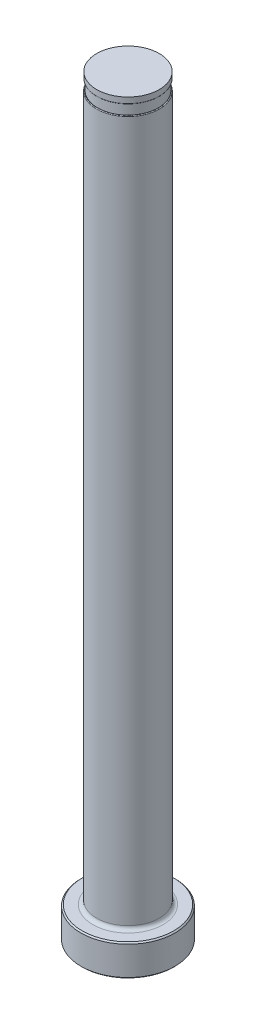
ISO-10303-21;
HEADER;
FILE_DESCRIPTION(('STEP AP214'),'2;1');
FILE_NAME('part.step','',(''),(''),'','','');
FILE_SCHEMA(('AUTOMOTIVE_DESIGN { 1 0 10303 214 1 1 1 1 }'));
ENDSEC;
DATA;
#1=APPLICATION_CONTEXT('core data for automotive mechanical design processes');
#2=APPLICATION_PROTOCOL_DEFINITION('international standard','automotive_design',2000,#1);
#3=PRODUCT_CONTEXT('',#1,'mechanical');
#4=PRODUCT('Part','Part','',(#3));
#5=PRODUCT_RELATED_PRODUCT_CATEGORY('part','',(#4));
#6=PRODUCT_DEFINITION_FORMATION('','',#4);
#7=PRODUCT_DEFINITION_CONTEXT('part definition',#1,'design');
#8=PRODUCT_DEFINITION('design','',#6,#7);
#9=PRODUCT_DEFINITION_SHAPE('','',#8);
#10=(LENGTH_UNIT() NAMED_UNIT(*) SI_UNIT(.MILLI.,.METRE.));
#11=(NAMED_UNIT(*) PLANE_ANGLE_UNIT() SI_UNIT($,.RADIAN.));
#12=(NAMED_UNIT(*) SI_UNIT($,.STERADIAN.) SOLID_ANGLE_UNIT());
#13=UNCERTAINTY_MEASURE_WITH_UNIT(LENGTH_MEASURE(1.E-05),#10,'distance_accuracy_value','');
#14=(GEOMETRIC_REPRESENTATION_CONTEXT(3) GLOBAL_UNCERTAINTY_ASSIGNED_CONTEXT((#13)) GLOBAL_UNIT_ASSIGNED_CONTEXT((#10,
#11,#12)) REPRESENTATION_CONTEXT('',''));
#15=CARTESIAN_POINT('',(0.,0.,0.));
#16=DIRECTION('',(0.,0.,1.));
#17=DIRECTION('',(1.,0.,0.));
#18=AXIS2_PLACEMENT_3D('',#15,#16,#17);
#19=CARTESIAN_POINT('',(-6.34999999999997,151.13,0.));
#20=DIRECTION('',(0.,1.,0.));
#21=DIRECTION('',(0.,0.,1.));
#22=AXIS2_PLACEMENT_3D('',#19,#20,#21);
#23=PLANE('',#22);
#24=CARTESIAN_POINT('',(0.,151.13,0.));
#25=DIRECTION('',(0.,1.,0.));
#26=DIRECTION('',(0.,0.,1.));
#27=AXIS2_PLACEMENT_3D('',#24,#25,#26);
#28=CIRCLE('',#27,6.20394999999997);
#29=CARTESIAN_POINT('',(0.,151.13,6.20394999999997));
#30=VERTEX_POINT('',#29);
#31=EDGE_CURVE('E11',#30,#30,#28,.F.);
#32=ORIENTED_EDGE('',*,*,#31,.T.);
#33=EDGE_LOOP('',(#32));
#34=FACE_BOUND('',#33,.T.);
#35=CARTESIAN_POINT('',(0.,151.13,0.));
#36=DIRECTION('',(0.,1.,0.));
#37=DIRECTION('',(0.,0.,1.));
#38=AXIS2_PLACEMENT_3D('',#35,#36,#37);
#39=CIRCLE('',#38,6.14679999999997);
#40=CARTESIAN_POINT('',(0.,151.13,6.14679999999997));
#41=VERTEX_POINT('',#40);
#42=EDGE_CURVE('E78',#41,#41,#39,.T.);
#43=ORIENTED_EDGE('',*,*,#42,.T.);
#44=EDGE_LOOP('',(#43));
#45=FACE_BOUND('',#44,.T.);
#46=ADVANCED_FACE('F36',(#34,#45),#23,.F.);
#47=CARTESIAN_POINT('',(0.,259.958771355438,0.));
#48=DIRECTION('',(0.,1.,0.));
#49=DIRECTION('',(0.,0.,1.));
#50=AXIS2_PLACEMENT_3D('',#47,#48,#49);
#51=CYLINDRICAL_SURFACE('',#50,6.34999999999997);
#52=DIRECTION('',(0.,1.,0.));
#53=VECTOR('',#52,1.);
#54=CARTESIAN_POINT('',(-6.14679999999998,259.958771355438,-1.59353373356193));
#55=LINE('',#54,#53);
#56=CARTESIAN_POINT('',(-6.14679999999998,148.971,-1.59353373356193));
#57=VERTEX_POINT('',#56);
#58=CARTESIAN_POINT('',(-6.14679999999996,86.614,-1.59353373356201));
#59=VERTEX_POINT('',#58);
#60=EDGE_CURVE('E73',#57,#59,#55,.F.);
#61=ORIENTED_EDGE('',*,*,#60,.F.);
#62=CARTESIAN_POINT('',(0.,148.971,0.));
#63=DIRECTION('',(0.,-1.,0.));
#64=DIRECTION('',(0.,0.,-1.));
#65=AXIS2_PLACEMENT_3D('',#62,#63,#64);
#66=CIRCLE('',#65,6.34999999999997);
#67=CARTESIAN_POINT('',(-6.14679999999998,148.971,1.59353373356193));
#68=VERTEX_POINT('',#67);
#69=EDGE_CURVE('E51',#57,#68,#66,.T.);
#70=ORIENTED_EDGE('',*,*,#69,.T.);
#71=DIRECTION('',(0.,1.,0.));
#72=VECTOR('',#71,1.);
#73=CARTESIAN_POINT('',(-6.14679999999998,259.958771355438,1.59353373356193));
#74=LINE('',#73,#72);
#75=CARTESIAN_POINT('',(-6.14679999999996,86.614,1.59353373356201));
#76=VERTEX_POINT('',#75);
#77=EDGE_CURVE('E84',#76,#68,#74,.T.);
#78=ORIENTED_EDGE('',*,*,#77,.F.);
#79=CARTESIAN_POINT('',(-6.14679999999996,86.614,-1.59353373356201));
#80=CARTESIAN_POINT('',(-6.14679686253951,86.5864663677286,-1.59353938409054));
#81=CARTESIAN_POINT('',(-6.14715862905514,86.5589529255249,-1.59215087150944));
#82=CARTESIAN_POINT('',(-6.14858031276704,86.5042441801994,-1.58665454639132));
#83=CARTESIAN_POINT('',(-6.1496395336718,86.4770485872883,-1.58254944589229));
#84=CARTESIAN_POINT('',(-6.15378495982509,86.3968935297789,-1.56638373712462));
#85=CARTESIAN_POINT('',(-6.15784047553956,86.3447192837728,-1.55046902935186));
#86=CARTESIAN_POINT('',(-6.16796669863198,86.2445368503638,-1.50967436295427));
#87=CARTESIAN_POINT('',(-6.17403041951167,86.1965149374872,-1.48482546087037));
#88=CARTESIAN_POINT('',(-6.18749023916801,86.1052134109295,-1.42770042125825));
#89=CARTESIAN_POINT('',(-6.19488985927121,86.0619468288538,-1.39540459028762));
#90=CARTESIAN_POINT('',(-6.2128308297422,85.9675154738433,-1.31357934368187));
#91=CARTESIAN_POINT('',(-6.22361527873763,85.9183096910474,-1.26185217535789));
#92=CARTESIAN_POINT('',(-6.24504791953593,85.8289285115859,-1.15112070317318));
#93=CARTESIAN_POINT('',(-6.25569585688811,85.7887681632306,-1.09210452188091));
#94=CARTESIAN_POINT('',(-6.27981252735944,85.703163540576,-0.94543699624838));
#95=CARTESIAN_POINT('',(-6.29280304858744,85.661570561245,-0.855464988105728));
#96=CARTESIAN_POINT('',(-6.3152685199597,85.59288021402,-0.669832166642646));
#97=CARTESIAN_POINT('',(-6.32474033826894,85.5657957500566,-0.574166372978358));
#98=CARTESIAN_POINT('',(-6.33958312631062,85.5242724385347,-0.377105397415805));
#99=CARTESIAN_POINT('',(-6.34483489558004,85.510199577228,-0.275625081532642));
#100=CARTESIAN_POINT('',(-6.35041977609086,85.4952595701,-0.0715187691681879));
#101=CARTESIAN_POINT('',(-6.35074885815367,85.494403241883,0.031108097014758));
#102=CARTESIAN_POINT('',(-6.34600640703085,85.5070416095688,0.256717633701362));
#103=CARTESIAN_POINT('',(-6.33980431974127,85.5235397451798,0.379522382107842));
#104=CARTESIAN_POINT('',(-6.32079279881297,85.576979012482,0.620117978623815));
#105=CARTESIAN_POINT('',(-6.30799326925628,85.6138895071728,0.737916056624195));
#106=CARTESIAN_POINT('',(-6.28320612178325,85.6928252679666,0.921417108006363));
#107=CARTESIAN_POINT('',(-6.27266140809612,85.7279385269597,0.990304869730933));
#108=CARTESIAN_POINT('',(-6.25047734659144,85.8081826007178,1.12180209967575));
#109=CARTESIAN_POINT('',(-6.23883987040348,85.8532964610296,1.18442193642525));
#110=CARTESIAN_POINT('',(-6.21836351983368,85.9425218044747,1.28706750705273));
#111=CARTESIAN_POINT('',(-6.20949901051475,85.9844586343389,1.32897137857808));
#112=CARTESIAN_POINT('',(-6.19260904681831,86.074662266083,1.40556985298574));
#113=CARTESIAN_POINT('',(-6.18458268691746,86.1229221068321,1.44027227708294));
#114=CARTESIAN_POINT('',(-6.17157345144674,86.215899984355,1.49493371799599));
#115=CARTESIAN_POINT('',(-6.16630262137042,86.2596744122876,1.51642497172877));
#116=CARTESIAN_POINT('',(-6.1574469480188,86.3502717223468,1.55199425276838));
#117=CARTESIAN_POINT('',(-6.15385883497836,86.3970884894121,1.56608666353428));
#118=CARTESIAN_POINT('',(-6.14982923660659,86.4725672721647,1.58181403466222));
#119=CARTESIAN_POINT('',(-6.14869942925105,86.5006434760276,1.58619374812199));
#120=CARTESIAN_POINT('',(-6.14718237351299,86.5571398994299,1.59205902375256));
#121=CARTESIAN_POINT('',(-6.14679576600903,86.5855603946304,1.59354208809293));
#122=CARTESIAN_POINT('',(-6.14679999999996,86.614,1.59353373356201));
#123=B_SPLINE_CURVE_WITH_KNOTS('',3,(#79,#80,#81,#82,#83,#84,#85,#86,#87,#88,#89,#90,#91,#92,
#93,#94,#95,#96,#97,#98,#99,#100,#101,#102,#103,#104,#105,#106,#107,#108,#109,#110,#111,#112,
#113,#114,#115,#116,#117,#118,#119,#120,#121,#122),.UNSPECIFIED.,.F.,.F.,(4,2,2,2,2,2,2,2,2,2,2,
2,2,2,2,2,2,2,2,2,2,4),(0.,0.0825255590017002,0.164968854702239,0.327951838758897,
0.490373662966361,0.653230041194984,0.868657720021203,1.08444118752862,1.38273372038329,
1.68129111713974,1.9880112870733,2.29498249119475,2.66541500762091,3.0352930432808,
3.2686988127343,3.50171186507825,3.68091203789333,3.85991655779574,4.00647458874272,
4.15274664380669,4.23791544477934,4.32315765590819),.UNSPECIFIED.);
#124=EDGE_CURVE('E81',#59,#76,#123,.T.);
#125=ORIENTED_EDGE('',*,*,#124,.F.);
#126=EDGE_LOOP('',(#61,#70,#78,#125));
#127=FACE_BOUND('',#126,.T.);
#128=CARTESIAN_POINT('',(0.,7.11200000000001,0.));
#129=DIRECTION('',(0.,1.,0.));
#130=DIRECTION('',(0.,0.,1.));
#131=AXIS2_PLACEMENT_3D('',#128,#129,#130);
#132=CIRCLE('',#131,6.34999999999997);
#133=CARTESIAN_POINT('',(0.,7.11200000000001,6.34999999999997));
#134=VERTEX_POINT('',#133);
#135=EDGE_CURVE('E116',#134,#134,#132,.T.);
#136=ORIENTED_EDGE('',*,*,#135,.T.);
#137=EDGE_LOOP('',(#136));
#138=FACE_BOUND('',#137,.T.);
#139=ADVANCED_FACE('F82',(#127,#138),#51,.T.);
#140=CARTESIAN_POINT('',(0.,0.,0.));
#141=DIRECTION('',(0.,-1.,0.));
#142=DIRECTION('',(0.,0.,-1.));
#143=AXIS2_PLACEMENT_3D('',#140,#141,#142);
#144=PLANE('',#143);
#145=CARTESIAN_POINT('',(0.,0.,0.));
#146=DIRECTION('',(0.,-1.,0.));
#147=DIRECTION('',(0.,0.,-1.));
#148=AXIS2_PLACEMENT_3D('',#145,#146,#147);
#149=CIRCLE('',#148,9.271);
#150=CARTESIAN_POINT('',(0.,0.,-9.271));
#151=VERTEX_POINT('',#150);
#152=EDGE_CURVE('E113',#151,#151,#149,.T.);
#153=ORIENTED_EDGE('',*,*,#152,.T.);
#154=EDGE_LOOP('',(#153));
#155=FACE_BOUND('',#154,.T.);
#156=ADVANCED_FACE('F192',(#155),#144,.T.);
#157=CARTESIAN_POINT('',(0.,259.958771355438,0.));
#158=DIRECTION('',(0.,1.,0.));
#159=DIRECTION('',(0.,0.,1.));
#160=AXIS2_PLACEMENT_3D('',#157,#158,#159);
#161=CYLINDRICAL_SURFACE('',#160,9.52499999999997);
#162=CARTESIAN_POINT('',(0.,6.09600000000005,0.));
#163=DIRECTION('',(0.,1.,0.));
#164=DIRECTION('',(0.,0.,1.));
#165=AXIS2_PLACEMENT_3D('',#162,#163,#164);
#166=CIRCLE('',#165,9.52499999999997);
#167=CARTESIAN_POINT('',(0.,6.09600000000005,9.52499999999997));
#168=VERTEX_POINT('',#167);
#169=EDGE_CURVE('E110',#168,#168,#166,.F.);
#170=ORIENTED_EDGE('',*,*,#169,.T.);
#171=EDGE_LOOP('',(#170));
#172=FACE_BOUND('',#171,.T.);
#173=CARTESIAN_POINT('',(0.,0.253999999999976,0.));
#174=DIRECTION('',(0.,-1.,0.));
#175=DIRECTION('',(0.,0.,-1.));
#176=AXIS2_PLACEMENT_3D('',#173,#174,#175);
#177=CIRCLE('',#176,9.52499999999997);
#178=CARTESIAN_POINT('',(0.,0.253999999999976,-9.52499999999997));
#179=VERTEX_POINT('',#178);
#180=EDGE_CURVE('E107',#179,#179,#177,.F.);
#181=ORIENTED_EDGE('',*,*,#180,.T.);
#182=EDGE_LOOP('',(#181));
#183=FACE_BOUND('',#182,.T.);
#184=ADVANCED_FACE('F195',(#172,#183),#161,.T.);
#185=CARTESIAN_POINT('',(-9.52499999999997,6.35,0.));
#186=DIRECTION('',(0.,1.,0.));
#187=DIRECTION('',(0.,0.,1.));
#188=AXIS2_PLACEMENT_3D('',#185,#186,#187);
#189=PLANE('',#188);
#190=CARTESIAN_POINT('',(0.,6.35,0.));
#191=DIRECTION('',(0.,1.,0.));
#192=DIRECTION('',(0.,0.,1.));
#193=AXIS2_PLACEMENT_3D('',#190,#191,#192);
#194=CIRCLE('',#193,7.11199999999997);
#195=CARTESIAN_POINT('',(0.,6.35,7.11199999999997));
#196=VERTEX_POINT('',#195);
#197=EDGE_CURVE('E87',#196,#196,#194,.F.);
#198=ORIENTED_EDGE('',*,*,#197,.T.);
#199=EDGE_LOOP('',(#198));
#200=FACE_BOUND('',#199,.T.);
#201=CARTESIAN_POINT('',(0.,6.35,0.));
#202=DIRECTION('',(0.,1.,0.));
#203=DIRECTION('',(0.,0.,1.));
#204=AXIS2_PLACEMENT_3D('',#201,#202,#203);
#205=CIRCLE('',#204,9.27100000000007);
#206=CARTESIAN_POINT('',(0.,6.35,9.27100000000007));
#207=VERTEX_POINT('',#206);
#208=EDGE_CURVE('E104',#207,#207,#205,.T.);
#209=ORIENTED_EDGE('',*,*,#208,.T.);
#210=EDGE_LOOP('',(#209));
#211=FACE_BOUND('',#210,.T.);
#212=ADVANCED_FACE('F190',(#200,#211),#189,.T.);
#213=CARTESIAN_POINT('',(0.,6.35000000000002,0.));
#214=DIRECTION('',(0.,-1.,0.));
#215=DIRECTION('',(0.,0.,-1.));
#216=AXIS2_PLACEMENT_3D('',#213,#214,#215);
#217=CONICAL_SURFACE('',#216,9.27100000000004,0.785398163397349);
#218=ORIENTED_EDGE('',*,*,#169,.F.);
#219=EDGE_LOOP('',(#218));
#220=FACE_BOUND('',#219,.T.);
#221=ORIENTED_EDGE('',*,*,#208,.F.);
#222=EDGE_LOOP('',(#221));
#223=FACE_BOUND('',#222,.T.);
#224=ADVANCED_FACE('F186',(#220,#223),#217,.T.);
#225=CARTESIAN_POINT('',(0.,0.253999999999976,0.));
#226=DIRECTION('',(0.,1.,0.));
#227=DIRECTION('',(0.,0.,1.));
#228=AXIS2_PLACEMENT_3D('',#225,#226,#227);
#229=CONICAL_SURFACE('',#228,9.52499999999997,0.785398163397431);
#230=ORIENTED_EDGE('',*,*,#152,.F.);
#231=EDGE_LOOP('',(#230));
#232=FACE_BOUND('',#231,.T.);
#233=ORIENTED_EDGE('',*,*,#180,.F.);
#234=EDGE_LOOP('',(#233));
#235=FACE_BOUND('',#234,.T.);
#236=ADVANCED_FACE('F182',(#232,#235),#229,.T.);
#237=CARTESIAN_POINT('',(0.,7.11200000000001,0.));
#238=DIRECTION('',(0.,1.,0.));
#239=DIRECTION('',(0.,0.,1.));
#240=AXIS2_PLACEMENT_3D('',#237,#238,#239);
#241=TOROIDAL_SURFACE('',#240,7.11199999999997,0.762);
#242=ORIENTED_EDGE('',*,*,#197,.F.);
#243=EDGE_LOOP('',(#242));
#244=FACE_BOUND('',#243,.T.);
#245=ORIENTED_EDGE('',*,*,#135,.F.);
#246=EDGE_LOOP('',(#245));
#247=FACE_BOUND('',#246,.T.);
#248=ADVANCED_FACE('F147',(#244,#247),#241,.F.);
#249=CARTESIAN_POINT('',(-6.34999999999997,149.098,0.));
#250=DIRECTION('',(0.,-1.,0.));
#251=DIRECTION('',(0.,0.,-1.));
#252=AXIS2_PLACEMENT_3D('',#249,#250,#251);
#253=PLANE('',#252);
#254=DIRECTION('',(0.,0.,1.));
#255=VECTOR('',#254,1.);
#256=CARTESIAN_POINT('',(-6.14679999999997,149.098,0.));
#257=LINE('',#256,#255);
#258=CARTESIAN_POINT('',(-6.14679999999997,149.098,0.));
#259=VERTEX_POINT('',#258);
#260=CARTESIAN_POINT('',(-6.14679999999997,149.098,0.970864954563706));
#261=VERTEX_POINT('',#260);
#262=EDGE_CURVE('E90',#259,#261,#257,.T.);
#263=ORIENTED_EDGE('',*,*,#262,.T.);
#264=CARTESIAN_POINT('',(0.,149.098,0.));
#265=DIRECTION('',(0.,-1.,0.));
#266=DIRECTION('',(0.,0.,-1.));
#267=AXIS2_PLACEMENT_3D('',#264,#265,#266);
#268=CIRCLE('',#267,6.22299999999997);
#269=CARTESIAN_POINT('',(-6.14679999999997,149.098,-0.970864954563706));
#270=VERTEX_POINT('',#269);
#271=EDGE_CURVE('E86',#261,#270,#268,.F.);
#272=ORIENTED_EDGE('',*,*,#271,.T.);
#273=EDGE_CURVE('E79',#270,#259,#257,.T.);
#274=ORIENTED_EDGE('',*,*,#273,.T.);
#275=CARTESIAN_POINT('',(0.,149.098,0.));
#276=DIRECTION('',(0.,1.,0.));
#277=DIRECTION('',(0.,0.,1.));
#278=AXIS2_PLACEMENT_3D('',#275,#276,#277);
#279=CIRCLE('',#278,6.14679999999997);
#280=EDGE_CURVE('E101',#259,#259,#279,.T.);
#281=ORIENTED_EDGE('',*,*,#280,.F.);
#282=EDGE_LOOP('',(#263,#272,#274,#281));
#283=FACE_BOUND('',#282,.T.);
#284=ADVANCED_FACE('F144',(#283),#253,.F.);
#285=CARTESIAN_POINT('',(0.,153.448281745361,0.));
#286=DIRECTION('',(0.,1.,0.));
#287=DIRECTION('',(0.,0.,1.));
#288=AXIS2_PLACEMENT_3D('',#285,#286,#287);
#289=CYLINDRICAL_SURFACE('',#288,6.14679999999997);
#290=ORIENTED_EDGE('',*,*,#42,.F.);
#291=EDGE_LOOP('',(#290));
#292=FACE_BOUND('',#291,.T.);
#293=ORIENTED_EDGE('',*,*,#280,.T.);
#294=EDGE_LOOP('',(#293));
#295=FACE_BOUND('',#294,.T.);
#296=ADVANCED_FACE('F141',(#292,#295),#289,.T.);
#297=CARTESIAN_POINT('',(-6.14679999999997,150.114,-9.52499999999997));
#298=DIRECTION('',(1.,0.,0.));
#299=DIRECTION('',(0.,1.,0.));
#300=AXIS2_PLACEMENT_3D('',#297,#298,#299);
#301=PLANE('',#300);
#302=ORIENTED_EDGE('',*,*,#273,.F.);
#303=CARTESIAN_POINT('',(-6.14679999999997,149.098,-0.970864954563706));
#304=CARTESIAN_POINT('',(-6.14679999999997,149.097999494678,-0.99202805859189));
#305=CARTESIAN_POINT('',(-6.14679999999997,149.09787177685,-1.01319058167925));
#306=CARTESIAN_POINT('',(-6.14679999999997,149.097304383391,-1.05551642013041));
#307=CARTESIAN_POINT('',(-6.14679999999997,149.096864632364,-1.07667973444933));
#308=CARTESIAN_POINT('',(-6.14679999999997,149.09498930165,-1.14021803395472));
#309=CARTESIAN_POINT('',(-6.14679999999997,149.092997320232,-1.18258174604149));
#310=CARTESIAN_POINT('',(-6.14679999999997,149.08836583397,-1.24564697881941));
#311=CARTESIAN_POINT('',(-6.14679999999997,149.086570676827,-1.26640955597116));
#312=CARTESIAN_POINT('',(-6.14679999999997,149.082292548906,-1.30785556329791));
#313=CARTESIAN_POINT('',(-6.14679999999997,149.079809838,-1.32853902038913));
#314=CARTESIAN_POINT('',(-6.14679999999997,149.07286463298,-1.37752764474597));
#315=CARTESIAN_POINT('',(-6.14679999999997,149.068008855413,-1.40578261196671));
#316=CARTESIAN_POINT('',(-6.14679999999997,149.057486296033,-1.45315312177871));
#317=CARTESIAN_POINT('',(-6.14679999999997,149.052522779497,-1.47241873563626));
#318=CARTESIAN_POINT('',(-6.14679999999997,149.042243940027,-1.50466142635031));
#319=CARTESIAN_POINT('',(-6.14679999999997,149.037474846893,-1.51780066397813));
#320=CARTESIAN_POINT('',(-6.14679999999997,149.028759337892,-1.53746298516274));
#321=CARTESIAN_POINT('',(-6.14679999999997,149.025436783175,-1.54425972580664));
#322=CARTESIAN_POINT('',(-6.14679999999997,149.018050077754,-1.55743156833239));
#323=CARTESIAN_POINT('',(-6.14679999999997,149.013989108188,-1.56380832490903));
#324=CARTESIAN_POINT('',(-6.14679999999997,149.007517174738,-1.5720869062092));
#325=CARTESIAN_POINT('',(-6.14679999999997,149.005591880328,-1.57436448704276));
#326=CARTESIAN_POINT('',(-6.14679999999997,149.001512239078,-1.57872030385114));
#327=CARTESIAN_POINT('',(-6.14679999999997,148.999357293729,-1.58079799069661));
#328=CARTESIAN_POINT('',(-6.14679999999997,148.994744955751,-1.58467787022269));
#329=CARTESIAN_POINT('',(-6.14679999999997,148.992283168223,-1.58647496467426));
#330=CARTESIAN_POINT('',(-6.14679999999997,148.987073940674,-1.58956779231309));
#331=CARTESIAN_POINT('',(-6.14679999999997,148.984329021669,-1.59086753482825));
#332=CARTESIAN_POINT('',(-6.14679999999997,148.979789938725,-1.59236406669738));
#333=CARTESIAN_POINT('',(-6.14679999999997,148.978073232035,-1.5927947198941));
#334=CARTESIAN_POINT('',(-6.14679999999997,148.974573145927,-1.59338315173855));
#335=CARTESIAN_POINT('',(-6.14679999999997,148.972789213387,-1.59353759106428));
#336=CARTESIAN_POINT('',(-6.14679999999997,148.971,-1.59353373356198));
#337=B_SPLINE_CURVE_WITH_KNOTS('',3,(#303,#304,#305,#306,#307,#308,#309,#310,#311,#312,#313,
#314,#315,#316,#317,#318,#319,#320,#321,#322,#323,#324,#325,#326,#327,#328,#329,#330,#331,#332,
#333,#334,#335,#336),.UNSPECIFIED.,.F.,.F.,(4,2,2,2,2,2,2,2,2,2,2,2,2,2,2,2,4),(0.,
0.0634873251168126,0.126989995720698,0.254174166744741,0.316684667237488,0.379171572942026,
0.465088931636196,0.524705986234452,0.566546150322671,0.589220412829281,0.611799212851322,
0.620735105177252,0.629694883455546,0.638802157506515,0.647834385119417,0.653123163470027,
0.658475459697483),.UNSPECIFIED.);
#338=EDGE_CURVE('E59',#270,#57,#337,.T.);
#339=ORIENTED_EDGE('',*,*,#338,.T.);
#340=ORIENTED_EDGE('',*,*,#60,.T.);
#341=DIRECTION('',(0.,0.,1.));
#342=VECTOR('',#341,1.);
#343=CARTESIAN_POINT('',(-6.14679999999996,86.614,-9.52499999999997));
#344=LINE('',#343,#342);
#345=EDGE_CURVE('E77',#59,#76,#344,.T.);
#346=ORIENTED_EDGE('',*,*,#345,.T.);
#347=ORIENTED_EDGE('',*,*,#77,.T.);
#348=CARTESIAN_POINT('',(-6.14679999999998,148.971,1.59353373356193));
#349=CARTESIAN_POINT('',(-6.14679999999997,148.973212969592,1.59354190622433));
#350=CARTESIAN_POINT('',(-6.14679999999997,148.975413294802,1.59330365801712));
#351=CARTESIAN_POINT('',(-6.14679999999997,148.9796934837,1.59241515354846));
#352=CARTESIAN_POINT('',(-6.14679999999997,148.981774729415,1.59177170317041));
#353=CARTESIAN_POINT('',(-6.14679999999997,148.986264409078,1.58996085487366));
#354=CARTESIAN_POINT('',(-6.14679999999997,148.988636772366,1.58870654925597));
#355=CARTESIAN_POINT('',(-6.14679999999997,148.993163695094,1.58583480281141));
#356=CARTESIAN_POINT('',(-6.14679999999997,148.995316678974,1.58421497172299));
#357=CARTESIAN_POINT('',(-6.14679999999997,149.001009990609,1.57937157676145));
#358=CARTESIAN_POINT('',(-6.14679999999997,149.004321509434,1.57588310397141));
#359=CARTESIAN_POINT('',(-6.14679999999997,149.010438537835,1.56850014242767));
#360=CARTESIAN_POINT('',(-6.14679999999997,149.01324308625,1.56460490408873));
#361=CARTESIAN_POINT('',(-6.14679999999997,149.01993924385,1.55433442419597));
#362=CARTESIAN_POINT('',(-6.14679999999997,149.023564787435,1.54778763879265));
#363=CARTESIAN_POINT('',(-6.14679999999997,149.030209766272,1.5343888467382));
#364=CARTESIAN_POINT('',(-6.14679999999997,149.033227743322,1.527536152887));
#365=CARTESIAN_POINT('',(-6.14679999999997,149.041649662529,1.5066491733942));
#366=CARTESIAN_POINT('',(-6.14679999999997,149.046386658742,1.49234856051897));
#367=CARTESIAN_POINT('',(-6.14679999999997,149.054853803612,1.46319301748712));
#368=CARTESIAN_POINT('',(-6.14679999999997,149.058564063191,1.44833273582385));
#369=CARTESIAN_POINT('',(-6.14679999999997,149.065191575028,1.41843325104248));
#370=CARTESIAN_POINT('',(-6.14679999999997,149.068108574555,1.40339399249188));
#371=CARTESIAN_POINT('',(-6.14679999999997,149.075988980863,1.3580554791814));
#372=CARTESIAN_POINT('',(-6.14679999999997,149.080064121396,1.32760471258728));
#373=CARTESIAN_POINT('',(-6.14679999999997,149.086693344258,1.26653961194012));
#374=CARTESIAN_POINT('',(-6.14679999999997,149.089246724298,1.23592520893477));
#375=CARTESIAN_POINT('',(-6.14679999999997,149.093251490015,1.1746618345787));
#376=CARTESIAN_POINT('',(-6.14679999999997,149.094704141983,1.1440129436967));
#377=CARTESIAN_POINT('',(-6.14679999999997,149.096556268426,1.08956123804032));
#378=CARTESIAN_POINT('',(-6.14679999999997,149.097118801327,1.06576333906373));
#379=CARTESIAN_POINT('',(-6.14679999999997,149.09783839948,1.01826491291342));
#380=CARTESIAN_POINT('',(-6.14679999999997,149.097997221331,0.994564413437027));
#381=CARTESIAN_POINT('',(-6.14679999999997,149.098,0.970864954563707));
#382=B_SPLINE_CURVE_WITH_KNOTS('',3,(#348,#349,#350,#351,#352,#353,#354,#355,#356,#357,#358,
#359,#360,#361,#362,#363,#364,#365,#366,#367,#368,#369,#370,#371,#372,#373,#374,#375,#376,#377,
#378,#379,#380,#381),.UNSPECIFIED.,.F.,.F.,(4,2,2,2,2,2,2,2,2,2,2,2,2,2,2,2,4),(0.,
0.00660592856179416,0.0131037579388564,0.0211086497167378,0.0291674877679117,0.0435165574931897,
0.0578925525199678,0.0802861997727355,0.102732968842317,0.147839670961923,0.193767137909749,
0.239709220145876,0.331806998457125,0.423947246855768,0.515981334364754,0.587391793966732,
0.658491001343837),.UNSPECIFIED.);
#383=EDGE_CURVE('E172',#68,#261,#382,.T.);
#384=ORIENTED_EDGE('',*,*,#383,.T.);
#385=ORIENTED_EDGE('',*,*,#262,.F.);
#386=EDGE_LOOP('',(#302,#339,#340,#346,#347,#384,#385));
#387=FACE_BOUND('',#386,.T.);
#388=ADVANCED_FACE('F75',(#387),#301,.F.);
#389=CARTESIAN_POINT('',(-9.32179999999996,86.614,-9.52499999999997));
#390=DIRECTION('',(0.,0.,1.));
#391=DIRECTION('',(1.,0.,0.));
#392=AXIS2_PLACEMENT_3D('',#389,#390,#391);
#393=CYLINDRICAL_SURFACE('',#392,3.175);
#394=ORIENTED_EDGE('',*,*,#345,.F.);
#395=ORIENTED_EDGE('',*,*,#124,.T.);
#396=EDGE_LOOP('',(#394,#395));
#397=FACE_BOUND('',#396,.T.);
#398=ADVANCED_FACE('F89',(#397),#393,.F.);
#399=CARTESIAN_POINT('',(0.,152.687735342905,0.));
#400=DIRECTION('',(0.,1.,0.));
#401=DIRECTION('',(0.,0.,1.));
#402=AXIS2_PLACEMENT_3D('',#399,#400,#401);
#403=CYLINDRICAL_SURFACE('',#402,6.33094999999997);
#404=CARTESIAN_POINT('',(0.,151.257,0.));
#405=DIRECTION('',(0.,1.,0.));
#406=DIRECTION('',(0.,0.,1.));
#407=AXIS2_PLACEMENT_3D('',#404,#405,#406);
#408=CIRCLE('',#407,6.33094999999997);
#409=CARTESIAN_POINT('',(0.,151.257,6.33094999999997));
#410=VERTEX_POINT('',#409);
#411=EDGE_CURVE('E44',#410,#410,#408,.T.);
#412=ORIENTED_EDGE('',*,*,#411,.T.);
#413=EDGE_LOOP('',(#412));
#414=FACE_BOUND('',#413,.T.);
#415=CARTESIAN_POINT('',(0.,152.4,0.));
#416=DIRECTION('',(0.,1.,0.));
#417=DIRECTION('',(0.,0.,1.));
#418=AXIS2_PLACEMENT_3D('',#415,#416,#417);
#419=CIRCLE('',#418,6.33094999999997);
#420=CARTESIAN_POINT('',(0.,152.4,6.33094999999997));
#421=VERTEX_POINT('',#420);
#422=EDGE_CURVE('E91',#421,#421,#419,.T.);
#423=ORIENTED_EDGE('',*,*,#422,.F.);
#424=EDGE_LOOP('',(#423));
#425=FACE_BOUND('',#424,.T.);
#426=ADVANCED_FACE('F135',(#414,#425),#403,.T.);
#427=CARTESIAN_POINT('',(-6.34999999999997,152.4,0.));
#428=DIRECTION('',(0.,1.,0.));
#429=DIRECTION('',(0.,0.,1.));
#430=AXIS2_PLACEMENT_3D('',#427,#428,#429);
#431=PLANE('',#430);
#432=ORIENTED_EDGE('',*,*,#422,.T.);
#433=EDGE_LOOP('',(#432));
#434=FACE_BOUND('',#433,.T.);
#435=ADVANCED_FACE('F149',(#434),#431,.T.);
#436=CARTESIAN_POINT('',(0.,148.971,0.));
#437=DIRECTION('',(0.,-1.,0.));
#438=DIRECTION('',(0.,0.,-1.));
#439=AXIS2_PLACEMENT_3D('',#436,#437,#438);
#440=TOROIDAL_SURFACE('',#439,6.22299999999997,0.127);
#441=ORIENTED_EDGE('',*,*,#383,.F.);
#442=ORIENTED_EDGE('',*,*,#69,.F.);
#443=ORIENTED_EDGE('',*,*,#338,.F.);
#444=ORIENTED_EDGE('',*,*,#271,.F.);
#445=EDGE_LOOP('',(#441,#442,#443,#444));
#446=FACE_BOUND('',#445,.T.);
#447=ADVANCED_FACE('F151',(#446),#440,.T.);
#448=CARTESIAN_POINT('',(0.,151.257,0.));
#449=DIRECTION('',(0.,1.,0.));
#450=DIRECTION('',(0.,0.,1.));
#451=AXIS2_PLACEMENT_3D('',#448,#449,#450);
#452=TOROIDAL_SURFACE('',#451,6.20394999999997,0.127);
#453=ORIENTED_EDGE('',*,*,#31,.F.);
#454=EDGE_LOOP('',(#453));
#455=FACE_BOUND('',#454,.T.);
#456=ORIENTED_EDGE('',*,*,#411,.F.);
#457=EDGE_LOOP('',(#456));
#458=FACE_BOUND('',#457,.T.);
#459=ADVANCED_FACE('F38',(#455,#458),#452,.T.);
#460=CLOSED_SHELL('',(#46,#139,#156,#184,#212,#224,#236,#248,#284,#296,#388,#398,#426,#435,#447,#459));
#461=MANIFOLD_SOLID_BREP('B2',#460);
#462=ADVANCED_BREP_SHAPE_REPRESENTATION('',(#18,#461),#14);
#463=SHAPE_DEFINITION_REPRESENTATION(#9,#462);
ENDSEC;
END-ISO-10303-21;
